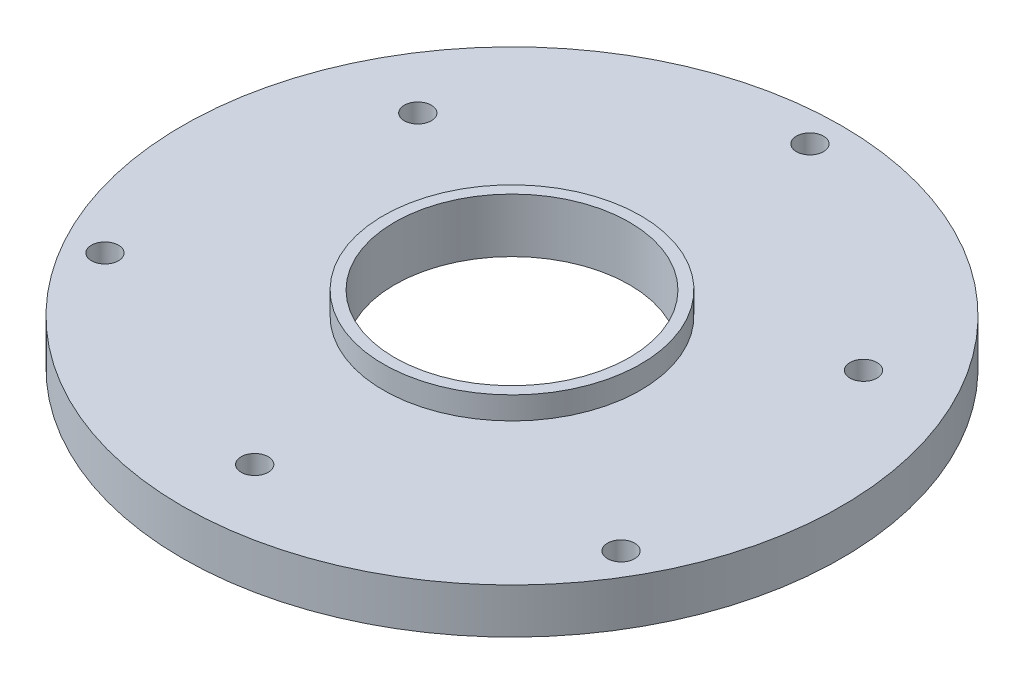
ISO-10303-21;
HEADER;
FILE_DESCRIPTION(('STEP AP214'),'2;1');
FILE_NAME('part.step','',(''),(''),'','','');
FILE_SCHEMA(('AUTOMOTIVE_DESIGN { 1 0 10303 214 1 1 1 1 }'));
ENDSEC;
DATA;
#1=APPLICATION_CONTEXT('core data for automotive mechanical design processes');
#2=APPLICATION_PROTOCOL_DEFINITION('international standard','automotive_design',2000,#1);
#3=PRODUCT_CONTEXT('',#1,'mechanical');
#4=PRODUCT('Part','Part','',(#3));
#5=PRODUCT_RELATED_PRODUCT_CATEGORY('part','',(#4));
#6=PRODUCT_DEFINITION_FORMATION('','',#4);
#7=PRODUCT_DEFINITION_CONTEXT('part definition',#1,'design');
#8=PRODUCT_DEFINITION('design','',#6,#7);
#9=PRODUCT_DEFINITION_SHAPE('','',#8);
#10=(LENGTH_UNIT() NAMED_UNIT(*) SI_UNIT(.MILLI.,.METRE.));
#11=(NAMED_UNIT(*) PLANE_ANGLE_UNIT() SI_UNIT($,.RADIAN.));
#12=(NAMED_UNIT(*) SI_UNIT($,.STERADIAN.) SOLID_ANGLE_UNIT());
#13=UNCERTAINTY_MEASURE_WITH_UNIT(LENGTH_MEASURE(1.E-05),#10,'distance_accuracy_value','');
#14=(GEOMETRIC_REPRESENTATION_CONTEXT(3) GLOBAL_UNCERTAINTY_ASSIGNED_CONTEXT((#13)) GLOBAL_UNIT_ASSIGNED_CONTEXT((#10,
#11,#12)) REPRESENTATION_CONTEXT('',''));
#15=CARTESIAN_POINT('',(0.,0.,0.));
#16=DIRECTION('',(0.,0.,1.));
#17=DIRECTION('',(1.,0.,0.));
#18=AXIS2_PLACEMENT_3D('',#15,#16,#17);
#19=CARTESIAN_POINT('',(0.,0.,0.));
#20=DIRECTION('',(0.,-1.,0.));
#21=DIRECTION('',(0.,0.,-1.));
#22=AXIS2_PLACEMENT_3D('',#19,#20,#21);
#23=CYLINDRICAL_SURFACE('',#22,14.25);
#24=CARTESIAN_POINT('',(0.,41.8859311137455,0.));
#25=DIRECTION('',(0.,-1.,0.));
#26=DIRECTION('',(0.,0.,-1.));
#27=AXIS2_PLACEMENT_3D('',#24,#25,#26);
#28=CIRCLE('',#27,14.25);
#29=CARTESIAN_POINT('',(0.,41.8859311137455,-14.25));
#30=VERTEX_POINT('',#29);
#31=EDGE_CURVE('E10',#30,#30,#28,.T.);
#32=ORIENTED_EDGE('',*,*,#31,.T.);
#33=EDGE_LOOP('',(#32));
#34=FACE_BOUND('',#33,.T.);
#35=CARTESIAN_POINT('',(0.,39.3859311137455,0.));
#36=DIRECTION('',(0.,-1.,0.));
#37=DIRECTION('',(0.,0.,-1.));
#38=AXIS2_PLACEMENT_3D('',#35,#36,#37);
#39=CIRCLE('',#38,14.25);
#40=CARTESIAN_POINT('',(0.,39.3859311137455,-14.25));
#41=VERTEX_POINT('',#40);
#42=EDGE_CURVE('E76',#41,#41,#39,.T.);
#43=ORIENTED_EDGE('',*,*,#42,.F.);
#44=EDGE_LOOP('',(#43));
#45=FACE_BOUND('',#44,.T.);
#46=ADVANCED_FACE('F39',(#34,#45),#23,.T.);
#47=CARTESIAN_POINT('',(13.,41.8859311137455,0.));
#48=DIRECTION('',(0.,1.,0.));
#49=DIRECTION('',(0.,0.,1.));
#50=AXIS2_PLACEMENT_3D('',#47,#48,#49);
#51=PLANE('',#50);
#52=CARTESIAN_POINT('',(0.,41.8859311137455,0.));
#53=DIRECTION('',(0.,-1.,0.));
#54=DIRECTION('',(0.,0.,-1.));
#55=AXIS2_PLACEMENT_3D('',#52,#53,#54);
#56=CIRCLE('',#55,13.);
#57=CARTESIAN_POINT('',(0.,41.8859311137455,-13.));
#58=VERTEX_POINT('',#57);
#59=EDGE_CURVE('E46',#58,#58,#56,.T.);
#60=ORIENTED_EDGE('',*,*,#59,.T.);
#61=EDGE_LOOP('',(#60));
#62=FACE_BOUND('',#61,.T.);
#63=ORIENTED_EDGE('',*,*,#31,.F.);
#64=EDGE_LOOP('',(#63));
#65=FACE_BOUND('',#64,.T.);
#66=ADVANCED_FACE('F109',(#62,#65),#51,.T.);
#67=CARTESIAN_POINT('',(0.,0.,0.));
#68=DIRECTION('',(0.,-1.,0.));
#69=DIRECTION('',(0.,0.,-1.));
#70=AXIS2_PLACEMENT_3D('',#67,#68,#69);
#71=CYLINDRICAL_SURFACE('',#70,13.);
#72=CARTESIAN_POINT('',(0.,35.8859311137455,0.));
#73=DIRECTION('',(0.,-1.,0.));
#74=DIRECTION('',(0.,0.,-1.));
#75=AXIS2_PLACEMENT_3D('',#72,#73,#74);
#76=CIRCLE('',#75,13.);
#77=CARTESIAN_POINT('',(0.,35.8859311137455,-13.));
#78=VERTEX_POINT('',#77);
#79=EDGE_CURVE('E51',#78,#78,#76,.T.);
#80=ORIENTED_EDGE('',*,*,#79,.T.);
#81=EDGE_LOOP('',(#80));
#82=FACE_BOUND('',#81,.T.);
#83=ORIENTED_EDGE('',*,*,#59,.F.);
#84=EDGE_LOOP('',(#83));
#85=FACE_BOUND('',#84,.T.);
#86=ADVANCED_FACE('F94',(#82,#85),#71,.F.);
#87=CARTESIAN_POINT('',(21.,35.8859311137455,0.));
#88=DIRECTION('',(0.,-1.,0.));
#89=DIRECTION('',(0.,0.,-1.));
#90=AXIS2_PLACEMENT_3D('',#87,#88,#89);
#91=PLANE('',#90);
#92=CARTESIAN_POINT('',(0.,35.8859311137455,0.));
#93=DIRECTION('',(0.,-1.,0.));
#94=DIRECTION('',(0.,0.,-1.));
#95=AXIS2_PLACEMENT_3D('',#92,#93,#94);
#96=CIRCLE('',#95,21.);
#97=CARTESIAN_POINT('',(0.,35.8859311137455,-21.));
#98=VERTEX_POINT('',#97);
#99=EDGE_CURVE('E89',#98,#98,#96,.T.);
#100=ORIENTED_EDGE('',*,*,#99,.T.);
#101=EDGE_LOOP('',(#100));
#102=FACE_BOUND('',#101,.T.);
#103=ORIENTED_EDGE('',*,*,#79,.F.);
#104=EDGE_LOOP('',(#103));
#105=FACE_BOUND('',#104,.T.);
#106=ADVANCED_FACE('F97',(#102,#105),#91,.T.);
#107=CARTESIAN_POINT('',(0.,0.,0.));
#108=DIRECTION('',(0.,-1.,0.));
#109=DIRECTION('',(0.,0.,-1.));
#110=AXIS2_PLACEMENT_3D('',#107,#108,#109);
#111=CYLINDRICAL_SURFACE('',#110,21.);
#112=CARTESIAN_POINT('',(0.,34.3859311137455,0.));
#113=DIRECTION('',(0.,-1.,0.));
#114=DIRECTION('',(0.,0.,-1.));
#115=AXIS2_PLACEMENT_3D('',#112,#113,#114);
#116=CIRCLE('',#115,21.);
#117=CARTESIAN_POINT('',(0.,34.3859311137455,-21.));
#118=VERTEX_POINT('',#117);
#119=EDGE_CURVE('E86',#118,#118,#116,.T.);
#120=ORIENTED_EDGE('',*,*,#119,.T.);
#121=EDGE_LOOP('',(#120));
#122=FACE_BOUND('',#121,.T.);
#123=ORIENTED_EDGE('',*,*,#99,.F.);
#124=EDGE_LOOP('',(#123));
#125=FACE_BOUND('',#124,.T.);
#126=ADVANCED_FACE('F99',(#122,#125),#111,.F.);
#127=CARTESIAN_POINT('',(21.,34.3859311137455,0.));
#128=DIRECTION('',(0.,-1.,0.));
#129=DIRECTION('',(0.,0.,-1.));
#130=AXIS2_PLACEMENT_3D('',#127,#128,#129);
#131=PLANE('',#130);
#132=CARTESIAN_POINT('',(0.,34.3859311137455,28.5));
#133=DIRECTION('',(0.,-1.,0.));
#134=DIRECTION('',(0.,0.,-1.));
#135=AXIS2_PLACEMENT_3D('',#132,#133,#134);
#136=CIRCLE('',#135,1.5);
#137=CARTESIAN_POINT('',(0.,34.3859311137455,27.));
#138=VERTEX_POINT('',#137);
#139=EDGE_CURVE('E58',#138,#138,#136,.T.);
#140=ORIENTED_EDGE('',*,*,#139,.F.);
#141=EDGE_LOOP('',(#140));
#142=FACE_BOUND('',#141,.T.);
#143=CARTESIAN_POINT('',(24.6817240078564,34.3859311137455,-14.2500000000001));
#144=DIRECTION('',(0.,-1.,0.));
#145=DIRECTION('',(0.,0.,-1.));
#146=AXIS2_PLACEMENT_3D('',#143,#144,#145);
#147=CIRCLE('',#146,1.5);
#148=CARTESIAN_POINT('',(24.6817240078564,34.3859311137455,-15.7500000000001));
#149=VERTEX_POINT('',#148);
#150=EDGE_CURVE('E169',#149,#149,#147,.T.);
#151=ORIENTED_EDGE('',*,*,#150,.F.);
#152=EDGE_LOOP('',(#151));
#153=FACE_BOUND('',#152,.T.);
#154=CARTESIAN_POINT('',(-24.6817240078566,34.3859311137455,-14.2499999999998));
#155=DIRECTION('',(0.,-1.,0.));
#156=DIRECTION('',(0.,0.,-1.));
#157=AXIS2_PLACEMENT_3D('',#154,#155,#156);
#158=CIRCLE('',#157,1.5);
#159=CARTESIAN_POINT('',(-24.6817240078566,34.3859311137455,-15.7499999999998));
#160=VERTEX_POINT('',#159);
#161=EDGE_CURVE('E172',#160,#160,#158,.T.);
#162=ORIENTED_EDGE('',*,*,#161,.F.);
#163=EDGE_LOOP('',(#162));
#164=FACE_BOUND('',#163,.T.);
#165=CARTESIAN_POINT('',(0.,34.3859311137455,-33.));
#166=DIRECTION('',(0.,1.,0.));
#167=DIRECTION('',(0.,0.,1.));
#168=AXIS2_PLACEMENT_3D('',#165,#166,#167);
#169=CIRCLE('',#168,1.5);
#170=CARTESIAN_POINT('',(0.,34.3859311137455,-31.5));
#171=VERTEX_POINT('',#170);
#172=EDGE_CURVE('E80',#171,#171,#169,.T.);
#173=ORIENTED_EDGE('',*,*,#172,.T.);
#174=EDGE_LOOP('',(#173));
#175=FACE_BOUND('',#174,.T.);
#176=CARTESIAN_POINT('',(28.5788383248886,34.3859311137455,16.4999999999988));
#177=DIRECTION('',(0.,1.,0.));
#178=DIRECTION('',(0.,0.,1.));
#179=AXIS2_PLACEMENT_3D('',#176,#177,#178);
#180=CIRCLE('',#179,1.5000000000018);
#181=CARTESIAN_POINT('',(28.5788383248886,34.3859311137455,18.0000000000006));
#182=VERTEX_POINT('',#181);
#183=EDGE_CURVE('E182',#182,#182,#180,.T.);
#184=ORIENTED_EDGE('',*,*,#183,.T.);
#185=EDGE_LOOP('',(#184));
#186=FACE_BOUND('',#185,.T.);
#187=CARTESIAN_POINT('',(-28.5788383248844,34.3859311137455,16.5000000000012));
#188=DIRECTION('',(0.,1.,0.));
#189=DIRECTION('',(0.,0.,1.));
#190=AXIS2_PLACEMENT_3D('',#187,#188,#189);
#191=CIRCLE('',#190,1.50000000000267);
#192=CARTESIAN_POINT('',(-28.5788383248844,34.3859311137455,18.0000000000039));
#193=VERTEX_POINT('',#192);
#194=EDGE_CURVE('E67',#193,#193,#191,.T.);
#195=ORIENTED_EDGE('',*,*,#194,.T.);
#196=EDGE_LOOP('',(#195));
#197=FACE_BOUND('',#196,.T.);
#198=CARTESIAN_POINT('',(0.,34.3859311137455,0.));
#199=DIRECTION('',(0.,-1.,0.));
#200=DIRECTION('',(0.,0.,-1.));
#201=AXIS2_PLACEMENT_3D('',#198,#199,#200);
#202=CIRCLE('',#201,36.5);
#203=CARTESIAN_POINT('',(0.,34.3859311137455,-36.5));
#204=VERTEX_POINT('',#203);
#205=EDGE_CURVE('E83',#204,#204,#202,.T.);
#206=ORIENTED_EDGE('',*,*,#205,.T.);
#207=EDGE_LOOP('',(#206));
#208=FACE_BOUND('',#207,.T.);
#209=ORIENTED_EDGE('',*,*,#119,.F.);
#210=EDGE_LOOP('',(#209));
#211=FACE_BOUND('',#210,.T.);
#212=ADVANCED_FACE('F106',(#142,#153,#164,#175,#186,#197,#208,#211),#131,.T.);
#213=CARTESIAN_POINT('',(0.,0.,0.));
#214=DIRECTION('',(0.,-1.,0.));
#215=DIRECTION('',(0.,0.,-1.));
#216=AXIS2_PLACEMENT_3D('',#213,#214,#215);
#217=CYLINDRICAL_SURFACE('',#216,36.5);
#218=CARTESIAN_POINT('',(0.,39.3859311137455,0.));
#219=DIRECTION('',(0.,-1.,0.));
#220=DIRECTION('',(0.,0.,-1.));
#221=AXIS2_PLACEMENT_3D('',#218,#219,#220);
#222=CIRCLE('',#221,36.5);
#223=CARTESIAN_POINT('',(0.,39.3859311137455,-36.5));
#224=VERTEX_POINT('',#223);
#225=EDGE_CURVE('E79',#224,#224,#222,.T.);
#226=ORIENTED_EDGE('',*,*,#225,.T.);
#227=EDGE_LOOP('',(#226));
#228=FACE_BOUND('',#227,.T.);
#229=ORIENTED_EDGE('',*,*,#205,.F.);
#230=EDGE_LOOP('',(#229));
#231=FACE_BOUND('',#230,.T.);
#232=ADVANCED_FACE('F123',(#228,#231),#217,.T.);
#233=CARTESIAN_POINT('',(14.25,39.3859311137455,0.));
#234=DIRECTION('',(0.,1.,0.));
#235=DIRECTION('',(0.,0.,1.));
#236=AXIS2_PLACEMENT_3D('',#233,#234,#235);
#237=PLANE('',#236);
#238=CARTESIAN_POINT('',(0.,39.3859311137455,28.5));
#239=DIRECTION('',(0.,1.,0.));
#240=DIRECTION('',(0.,0.,1.));
#241=AXIS2_PLACEMENT_3D('',#238,#239,#240);
#242=CIRCLE('',#241,1.5);
#243=CARTESIAN_POINT('',(0.,39.3859311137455,30.));
#244=VERTEX_POINT('',#243);
#245=EDGE_CURVE('E42',#244,#244,#242,.T.);
#246=ORIENTED_EDGE('',*,*,#245,.F.);
#247=EDGE_LOOP('',(#246));
#248=FACE_BOUND('',#247,.T.);
#249=CARTESIAN_POINT('',(24.6817240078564,39.3859311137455,-14.2500000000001));
#250=DIRECTION('',(0.,1.,0.));
#251=DIRECTION('',(0.,0.,1.));
#252=AXIS2_PLACEMENT_3D('',#249,#250,#251);
#253=CIRCLE('',#252,1.5);
#254=CARTESIAN_POINT('',(24.6817240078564,39.3859311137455,-12.7500000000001));
#255=VERTEX_POINT('',#254);
#256=EDGE_CURVE('E57',#255,#255,#253,.T.);
#257=ORIENTED_EDGE('',*,*,#256,.F.);
#258=EDGE_LOOP('',(#257));
#259=FACE_BOUND('',#258,.T.);
#260=CARTESIAN_POINT('',(-24.6817240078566,39.3859311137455,-14.2499999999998));
#261=DIRECTION('',(0.,1.,0.));
#262=DIRECTION('',(0.,0.,1.));
#263=AXIS2_PLACEMENT_3D('',#260,#261,#262);
#264=CIRCLE('',#263,1.5);
#265=CARTESIAN_POINT('',(-24.6817240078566,39.3859311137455,-12.7499999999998));
#266=VERTEX_POINT('',#265);
#267=EDGE_CURVE('E55',#266,#266,#264,.T.);
#268=ORIENTED_EDGE('',*,*,#267,.F.);
#269=EDGE_LOOP('',(#268));
#270=FACE_BOUND('',#269,.T.);
#271=CARTESIAN_POINT('',(0.,39.3859311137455,-33.));
#272=DIRECTION('',(0.,1.,0.));
#273=DIRECTION('',(0.,0.,1.));
#274=AXIS2_PLACEMENT_3D('',#271,#272,#273);
#275=CIRCLE('',#274,1.5);
#276=CARTESIAN_POINT('',(0.,39.3859311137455,-31.5));
#277=VERTEX_POINT('',#276);
#278=EDGE_CURVE('E179',#277,#277,#275,.T.);
#279=ORIENTED_EDGE('',*,*,#278,.F.);
#280=EDGE_LOOP('',(#279));
#281=FACE_BOUND('',#280,.T.);
#282=CARTESIAN_POINT('',(28.5788383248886,39.3859311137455,16.4999999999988));
#283=DIRECTION('',(0.,1.,0.));
#284=DIRECTION('',(0.,0.,1.));
#285=AXIS2_PLACEMENT_3D('',#282,#283,#284);
#286=CIRCLE('',#285,1.5000000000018);
#287=CARTESIAN_POINT('',(28.5788383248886,39.3859311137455,18.0000000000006));
#288=VERTEX_POINT('',#287);
#289=EDGE_CURVE('E72',#288,#288,#286,.T.);
#290=ORIENTED_EDGE('',*,*,#289,.F.);
#291=EDGE_LOOP('',(#290));
#292=FACE_BOUND('',#291,.T.);
#293=CARTESIAN_POINT('',(-28.5788383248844,39.3859311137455,16.5000000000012));
#294=DIRECTION('',(0.,1.,0.));
#295=DIRECTION('',(0.,0.,1.));
#296=AXIS2_PLACEMENT_3D('',#293,#294,#295);
#297=CIRCLE('',#296,1.50000000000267);
#298=CARTESIAN_POINT('',(-28.5788383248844,39.3859311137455,18.0000000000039));
#299=VERTEX_POINT('',#298);
#300=EDGE_CURVE('E63',#299,#299,#297,.T.);
#301=ORIENTED_EDGE('',*,*,#300,.F.);
#302=EDGE_LOOP('',(#301));
#303=FACE_BOUND('',#302,.T.);
#304=ORIENTED_EDGE('',*,*,#42,.T.);
#305=EDGE_LOOP('',(#304));
#306=FACE_BOUND('',#305,.T.);
#307=ORIENTED_EDGE('',*,*,#225,.F.);
#308=EDGE_LOOP('',(#307));
#309=FACE_BOUND('',#308,.T.);
#310=ADVANCED_FACE('F119',(#248,#259,#270,#281,#292,#303,#306,#309),#237,.T.);
#311=CARTESIAN_POINT('',(-28.5788383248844,34.3859311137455,16.5000000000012));
#312=DIRECTION('',(0.,1.,0.));
#313=DIRECTION('',(0.,0.,1.));
#314=AXIS2_PLACEMENT_3D('',#311,#312,#313);
#315=CYLINDRICAL_SURFACE('',#314,1.50000000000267);
#316=ORIENTED_EDGE('',*,*,#194,.F.);
#317=EDGE_LOOP('',(#316));
#318=FACE_BOUND('',#317,.T.);
#319=ORIENTED_EDGE('',*,*,#300,.T.);
#320=EDGE_LOOP('',(#319));
#321=FACE_BOUND('',#320,.T.);
#322=ADVANCED_FACE('F122',(#318,#321),#315,.F.);
#323=CARTESIAN_POINT('',(28.5788383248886,34.3859311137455,16.4999999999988));
#324=DIRECTION('',(0.,1.,0.));
#325=DIRECTION('',(0.,0.,1.));
#326=AXIS2_PLACEMENT_3D('',#323,#324,#325);
#327=CYLINDRICAL_SURFACE('',#326,1.5000000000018);
#328=ORIENTED_EDGE('',*,*,#183,.F.);
#329=EDGE_LOOP('',(#328));
#330=FACE_BOUND('',#329,.T.);
#331=ORIENTED_EDGE('',*,*,#289,.T.);
#332=EDGE_LOOP('',(#331));
#333=FACE_BOUND('',#332,.T.);
#334=ADVANCED_FACE('F147',(#330,#333),#327,.F.);
#335=CARTESIAN_POINT('',(0.,34.3859311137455,-33.));
#336=DIRECTION('',(0.,1.,0.));
#337=DIRECTION('',(0.,0.,1.));
#338=AXIS2_PLACEMENT_3D('',#335,#336,#337);
#339=CYLINDRICAL_SURFACE('',#338,1.5);
#340=ORIENTED_EDGE('',*,*,#172,.F.);
#341=EDGE_LOOP('',(#340));
#342=FACE_BOUND('',#341,.T.);
#343=ORIENTED_EDGE('',*,*,#278,.T.);
#344=EDGE_LOOP('',(#343));
#345=FACE_BOUND('',#344,.T.);
#346=ADVANCED_FACE('F151',(#342,#345),#339,.F.);
#347=CARTESIAN_POINT('',(-24.6817240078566,41.8859311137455,-14.2499999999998));
#348=DIRECTION('',(0.,-1.,0.));
#349=DIRECTION('',(0.,0.,-1.));
#350=AXIS2_PLACEMENT_3D('',#347,#348,#349);
#351=CYLINDRICAL_SURFACE('',#350,1.5);
#352=ORIENTED_EDGE('',*,*,#267,.T.);
#353=EDGE_LOOP('',(#352));
#354=FACE_BOUND('',#353,.T.);
#355=ORIENTED_EDGE('',*,*,#161,.T.);
#356=EDGE_LOOP('',(#355));
#357=FACE_BOUND('',#356,.T.);
#358=ADVANCED_FACE('F155',(#354,#357),#351,.F.);
#359=CARTESIAN_POINT('',(24.6817240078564,41.8859311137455,-14.2500000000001));
#360=DIRECTION('',(0.,-1.,0.));
#361=DIRECTION('',(0.,0.,-1.));
#362=AXIS2_PLACEMENT_3D('',#359,#360,#361);
#363=CYLINDRICAL_SURFACE('',#362,1.5);
#364=ORIENTED_EDGE('',*,*,#256,.T.);
#365=EDGE_LOOP('',(#364));
#366=FACE_BOUND('',#365,.T.);
#367=ORIENTED_EDGE('',*,*,#150,.T.);
#368=EDGE_LOOP('',(#367));
#369=FACE_BOUND('',#368,.T.);
#370=ADVANCED_FACE('F159',(#366,#369),#363,.F.);
#371=CARTESIAN_POINT('',(0.,41.8859311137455,28.5));
#372=DIRECTION('',(0.,-1.,0.));
#373=DIRECTION('',(0.,0.,-1.));
#374=AXIS2_PLACEMENT_3D('',#371,#372,#373);
#375=CYLINDRICAL_SURFACE('',#374,1.5);
#376=ORIENTED_EDGE('',*,*,#245,.T.);
#377=EDGE_LOOP('',(#376));
#378=FACE_BOUND('',#377,.T.);
#379=ORIENTED_EDGE('',*,*,#139,.T.);
#380=EDGE_LOOP('',(#379));
#381=FACE_BOUND('',#380,.T.);
#382=ADVANCED_FACE('F163',(#378,#381),#375,.F.);
#383=CLOSED_SHELL('',(#46,#66,#86,#106,#126,#212,#232,#310,#322,#334,#346,#358,#370,#382));
#384=MANIFOLD_SOLID_BREP('B2',#383);
#385=ADVANCED_BREP_SHAPE_REPRESENTATION('',(#18,#384),#14);
#386=SHAPE_DEFINITION_REPRESENTATION(#9,#385);
ENDSEC;
END-ISO-10303-21;
